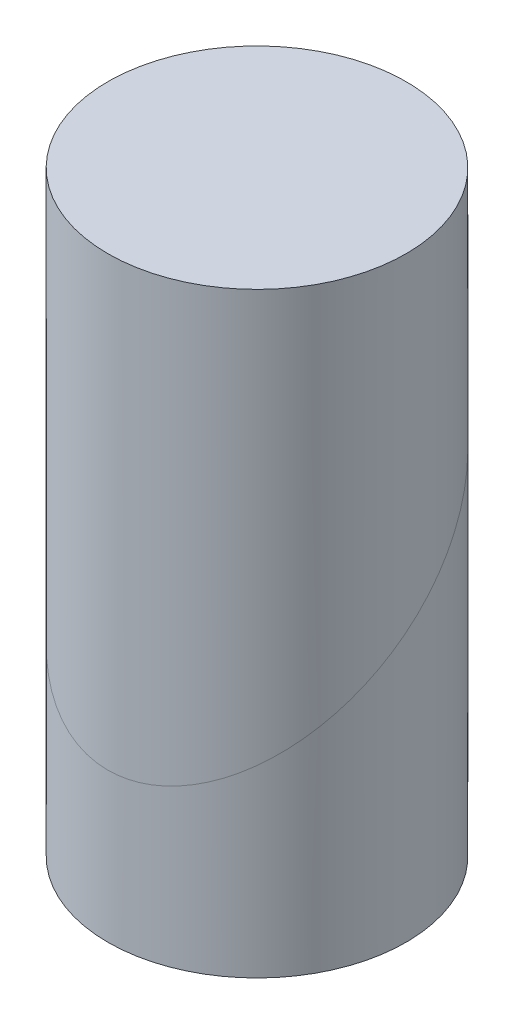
ISO-10303-21;
HEADER;
FILE_DESCRIPTION(('STEP AP214'),'2;1');
FILE_NAME('part.step','',(''),(''),'','','');
FILE_SCHEMA(('AUTOMOTIVE_DESIGN { 1 0 10303 214 1 1 1 1 }'));
ENDSEC;
DATA;
#1=APPLICATION_CONTEXT('core data for automotive mechanical design processes');
#2=APPLICATION_PROTOCOL_DEFINITION('international standard','automotive_design',2000,#1);
#3=PRODUCT_CONTEXT('',#1,'mechanical');
#4=PRODUCT('Part','Part','',(#3));
#5=PRODUCT_RELATED_PRODUCT_CATEGORY('part','',(#4));
#6=PRODUCT_DEFINITION_FORMATION('','',#4);
#7=PRODUCT_DEFINITION_CONTEXT('part definition',#1,'design');
#8=PRODUCT_DEFINITION('design','',#6,#7);
#9=PRODUCT_DEFINITION_SHAPE('','',#8);
#10=(LENGTH_UNIT() NAMED_UNIT(*) SI_UNIT(.MILLI.,.METRE.));
#11=(NAMED_UNIT(*) PLANE_ANGLE_UNIT() SI_UNIT($,.RADIAN.));
#12=(NAMED_UNIT(*) SI_UNIT($,.STERADIAN.) SOLID_ANGLE_UNIT());
#13=UNCERTAINTY_MEASURE_WITH_UNIT(LENGTH_MEASURE(1.E-05),#10,'distance_accuracy_value','');
#14=(GEOMETRIC_REPRESENTATION_CONTEXT(3) GLOBAL_UNCERTAINTY_ASSIGNED_CONTEXT((#13)) GLOBAL_UNIT_ASSIGNED_CONTEXT((#10,
#11,#12)) REPRESENTATION_CONTEXT('',''));
#15=CARTESIAN_POINT('',(0.,0.,0.));
#16=DIRECTION('',(0.,0.,1.));
#17=DIRECTION('',(1.,0.,0.));
#18=AXIS2_PLACEMENT_3D('',#15,#16,#17);
#19=CARTESIAN_POINT('',(0.,100.,0.));
#20=DIRECTION('',(0.,-1.,0.));
#21=DIRECTION('',(0.,0.,-1.));
#22=AXIS2_PLACEMENT_3D('',#19,#20,#21);
#23=CYLINDRICAL_SURFACE('',#22,25.);
#24=CARTESIAN_POINT('',(0.,100.,0.));
#25=DIRECTION('',(0.,1.,0.));
#26=DIRECTION('',(0.,0.,1.));
#27=AXIS2_PLACEMENT_3D('',#24,#25,#26);
#28=CIRCLE('',#27,25.);
#29=CARTESIAN_POINT('',(0.,100.,25.));
#30=VERTEX_POINT('',#29);
#31=EDGE_CURVE('E59',#30,#30,#28,.T.);
#32=ORIENTED_EDGE('',*,*,#31,.F.);
#33=EDGE_LOOP('',(#32));
#34=FACE_BOUND('',#33,.T.);
#35=CARTESIAN_POINT('',(0.,45.,0.));
#36=DIRECTION('',(0.,-0.78086880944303,-0.624695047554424));
#37=DIRECTION('',(0.,-0.624695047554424,0.78086880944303));
#38=AXIS2_PLACEMENT_3D('',#35,#36,#37);
#39=ELLIPSE('',#38,32.0156211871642,25.);
#40=CARTESIAN_POINT('',(0.,25.,25.));
#41=VERTEX_POINT('',#40);
#42=CARTESIAN_POINT('',(-25.,45.,0.));
#43=VERTEX_POINT('',#42);
#44=EDGE_CURVE('E11',#41,#43,#39,.T.);
#45=ORIENTED_EDGE('',*,*,#44,.F.);
#46=CARTESIAN_POINT('',(0.,65.,-25.));
#47=VERTEX_POINT('',#46);
#48=EDGE_CURVE('E39',#47,#41,#39,.T.);
#49=ORIENTED_EDGE('',*,*,#48,.F.);
#50=EDGE_CURVE('E45',#43,#47,#39,.T.);
#51=ORIENTED_EDGE('',*,*,#50,.F.);
#52=EDGE_LOOP('',(#45,#49,#51));
#53=FACE_BOUND('',#52,.T.);
#54=ADVANCED_FACE('F35',(#34,#53),#23,.T.);
#55=ORIENTED_EDGE('',*,*,#48,.T.);
#56=ORIENTED_EDGE('',*,*,#44,.T.);
#57=ORIENTED_EDGE('',*,*,#50,.T.);
#58=EDGE_LOOP('',(#55,#56,#57));
#59=FACE_BOUND('',#58,.T.);
#60=CARTESIAN_POINT('',(0.,0.,0.));
#61=DIRECTION('',(0.,1.,0.));
#62=DIRECTION('',(0.,0.,1.));
#63=AXIS2_PLACEMENT_3D('',#60,#61,#62);
#64=CIRCLE('',#63,25.);
#65=CARTESIAN_POINT('',(0.,0.,25.));
#66=VERTEX_POINT('',#65);
#67=EDGE_CURVE('E63',#66,#66,#64,.T.);
#68=ORIENTED_EDGE('',*,*,#67,.T.);
#69=EDGE_LOOP('',(#68));
#70=FACE_BOUND('',#69,.T.);
#71=ADVANCED_FACE('F37',(#59,#70),#23,.T.);
#72=CARTESIAN_POINT('',(0.,100.,0.));
#73=DIRECTION('',(0.,1.,0.));
#74=DIRECTION('',(0.,0.,1.));
#75=AXIS2_PLACEMENT_3D('',#72,#73,#74);
#76=PLANE('',#75);
#77=ORIENTED_EDGE('',*,*,#31,.T.);
#78=EDGE_LOOP('',(#77));
#79=FACE_BOUND('',#78,.T.);
#80=ADVANCED_FACE('F72',(#79),#76,.T.);
#81=CARTESIAN_POINT('',(0.,0.,0.));
#82=DIRECTION('',(0.,1.,0.));
#83=DIRECTION('',(0.,0.,1.));
#84=AXIS2_PLACEMENT_3D('',#81,#82,#83);
#85=PLANE('',#84);
#86=ORIENTED_EDGE('',*,*,#67,.F.);
#87=EDGE_LOOP('',(#86));
#88=FACE_BOUND('',#87,.T.);
#89=ADVANCED_FACE('F70',(#88),#85,.F.);
#90=CLOSED_SHELL('',(#54,#71,#80,#89));
#91=MANIFOLD_SOLID_BREP('B2',#90);
#92=ADVANCED_BREP_SHAPE_REPRESENTATION('',(#18,#91),#14);
#93=SHAPE_DEFINITION_REPRESENTATION(#9,#92);
ENDSEC;
END-ISO-10303-21;
